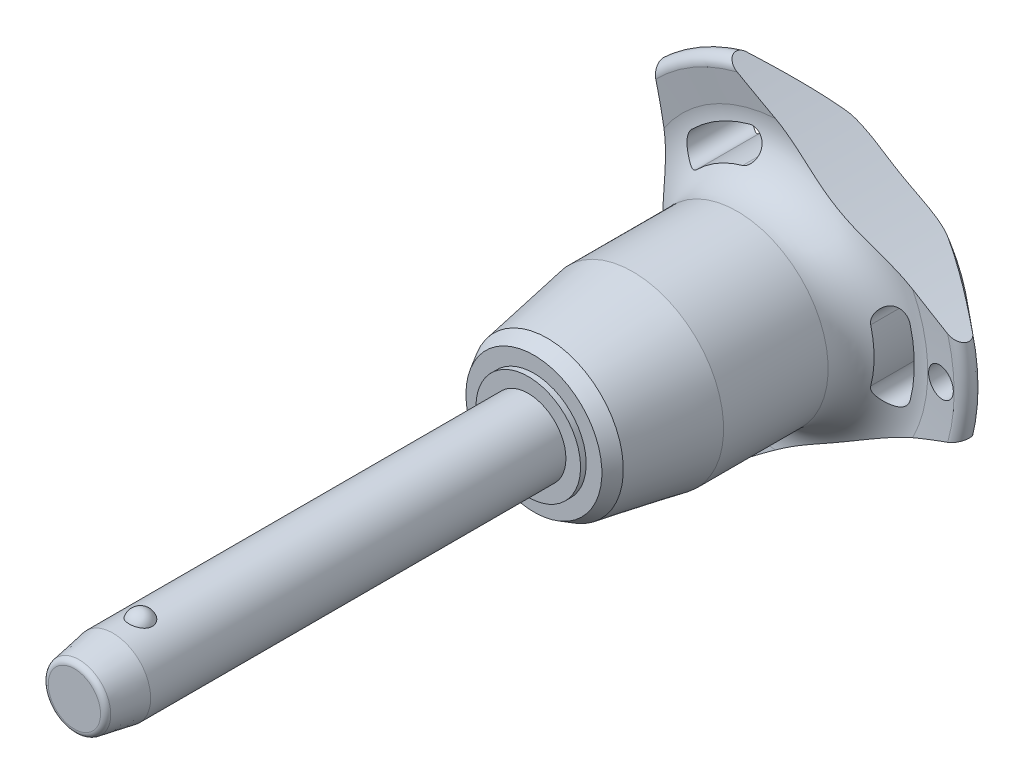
from build123d import *

# Parameters (mm, degrees)
SKETCH1_R           = 4
BOSS_EXTRUDE1_DEPTH = 40
SKETCH2_R           = 3.4
BOSS_EXTRUDE2_DEPTH = 33.3
BOSS_EXTRUDE3_START = 8.2
SKETCH1_2_R         = 4
BOSS_EXTRUDE3_DEPTH = 8.2
CHAMFER1_SIZE       = 4.1
CHAMFER1_SIZE2      = 0.722940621
FILLET1_R           = 0.6
SKETCH6_R           = 102.8
CUT_EXTRUDE1_DEPTH  = 79.369242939
CIRPATTERN1_COUNT   = 3
SKETCH7_R           = 1.5
CUT_EXTRUDE2_DEPTH  = 79.162591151


with BuildPart() as part:
    # Sketch1 → Boss-Extrude1 (new body)
    with BuildSketch(Plane.XY):
        Circle(SKETCH1_R)
    extrude(amount=-BOSS_EXTRUDE1_DEPTH)

    # Sketch2 → Boss-Extrude2 (add)
    with BuildSketch(Plane(origin=(0, 0, -40), x_dir=(-1, 0, 0), z_dir=(0, 0, -1))):
        Circle(SKETCH2_R)
    extrude(amount=BOSS_EXTRUDE2_DEPTH)

    # Sketch3 → Revolve1 (revolve)
    with BuildSketch(Plane(origin=(0, 0, 0), x_dir=(0, 0, -1), z_dir=(1, 0, 0))):
        with BuildLine():
            Line((-1.2, 4.8), (-1.2, 2.2))
            ThreePointArc((-1.2, 2.2), (0.1, 3.5), (-1.2, 4.8))
        make_face()
        with BuildLine():
            Line((-1.2, -2.2), (-1.2, -4.8))
            ThreePointArc((-1.2, -4.8), (0.1, -3.5), (-1.2, -2.2))
        make_face()
    revolve(axis=Axis((0, -2.2, 1.2), (0, 1, 0)))

    # Sketch1_2 → Boss-Extrude3 (add)
    with BuildSketch(Plane.XY.offset(BOSS_EXTRUDE3_START)):
        Circle(SKETCH1_2_R)
    extrude(amount=-BOSS_EXTRUDE3_DEPTH)

    # Chamfer1
    chamfer1_edges = [part.edges().sort_by_distance(p)[0] for p in [
        (-4, 0, 8.2),
    ]]
    chamfer1_side = [part.faces().sort_by_distance(p)[0] for p in [
        (-4, 0, -15.9),
    ]]
    chamfer(chamfer1_edges, length=CHAMFER1_SIZE, length2=CHAMFER1_SIZE2, reference=chamfer1_side[0])

    # Fillet1
    fillet1_edges = [part.edges().sort_by_distance(p)[0] for p in [
        (-3.277059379, 0, 8.2),
        (3.4, 0, -73.3),
    ]]
    fillet(fillet1_edges, radius=FILLET1_R)

    # Sketch4 → Revolve2 (revolve)
    with BuildSketch(Plane(origin=(0, 0, 0), x_dir=(0, 0, -1), z_dir=(1, 0, 0)), mode=Mode.PRIVATE) as revolve2_sk:
        Polygon((40, 0), (40, 5.554101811), (40.6, 5.554101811), (40.6, 7.220004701), (42.042714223, 8.052956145), (51.1, 9.65), (62.2, 9.65), (62.2, 0), align=None)
    revolve(revolve2_sk.sketch.rotate(Axis((0, 0, -62.2), (0, 0, 1)), 90), axis=Axis((0, 0, -62.2), (0, 0, 1)))

    # Sketch5 → Revolve3 (revolve)
    with BuildSketch(Plane(origin=(0, 0, 0), x_dir=(0, 0, -1), z_dir=(1, 0, 0)), mode=Mode.PRIVATE) as revolve3_sk:
        with BuildLine():
            Line((67.16082631, 15.274661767), (66.757834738, 18.475067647))
            ThreePointArc((66.757834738, 18.475067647), (67.349836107, 19.516443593), (68.516044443, 19.24278761))
            Line((68.516044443, 19.24278761), (72.835691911, 14.094832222))
            ThreePointArc((72.835691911, 14.094832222), (73.3, 12.689260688), (72.67067517, 11.349423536))
            ThreePointArc((72.67067517, 11.349423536), (69.033110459, 6.185112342), (67.75, 0))
            Line((67.75, 0), (62.2, 0))
            Line((62.2, 0), (62.2, 9.65))
            ThreePointArc((62.2, 9.65), (65.949887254, 11.342683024), (67.16082631, 15.274661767))
        make_face()
    revolve(revolve3_sk.sketch.rotate(Axis((0, 0, -67.75), (0, 0, 1)), 90), axis=Axis((0, 0, -67.75), (0, 0, 1)))

    # Sketch6 → Cut-Extrude1 (cut, through all)
    with BuildSketch(Plane.XY):
        with Locations((-115.2, 0)):
            Circle(SKETCH6_R)
        with BuildLine():
            ThreePointArc((13.411913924, -3.529271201), (13.868496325, 0), (13.411913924, 3.529271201))
            ThreePointArc((13.411913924, 3.529271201), (11.694200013, 4.531299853), (10.692171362, 2.813585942))
            ThreePointArc((10.692171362, 2.813585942), (11.056165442, 0), (10.692171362, -2.813585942))
            ThreePointArc((10.692171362, -2.813585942), (11.694200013, -4.531299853), (13.411913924, -3.529271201))
        make_face()
    cut_extrude1 = extrude(amount=-CUT_EXTRUDE1_DEPTH, mode=Mode.SUBTRACT)

    # CirPattern1: Cut-Extrude1 ×3 about axis
    cirpattern1_axis = Axis((0, 0, 0), (0, 0, 1))
    for i in range(1, CIRPATTERN1_COUNT):
        add(cut_extrude1.rotate(cirpattern1_axis, i * 360 / CIRPATTERN1_COUNT), mode=Mode.SUBTRACT)

    # Sketch7 → Cut-Extrude2 (cut, through all)
    with BuildSketch(Plane.XY):
        with Locations(Location((16.868496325, 0, 0), (0, 0, 225.467095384))):
            Circle(SKETCH7_R)
    extrude(amount=-CUT_EXTRUDE2_DEPTH, mode=Mode.SUBTRACT)


solid = part.part
